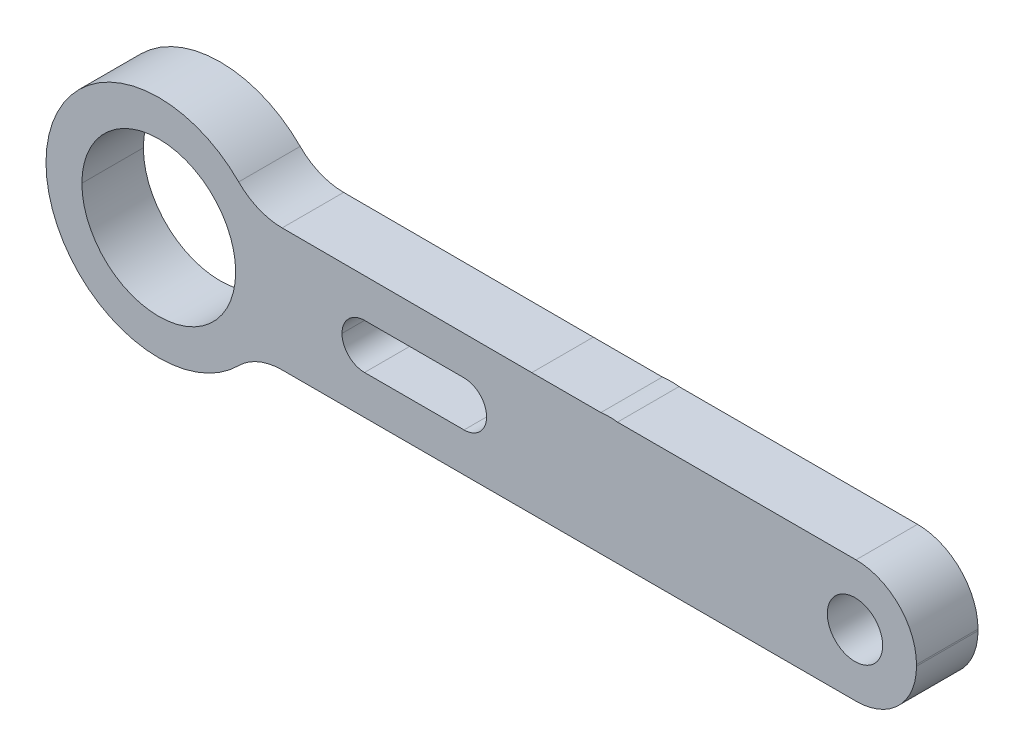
ISO-10303-21;
HEADER;
FILE_DESCRIPTION(('STEP AP214'),'2;1');
FILE_NAME('part.step','',(''),(''),'','','');
FILE_SCHEMA(('AUTOMOTIVE_DESIGN { 1 0 10303 214 1 1 1 1 }'));
ENDSEC;
DATA;
#1=APPLICATION_CONTEXT('core data for automotive mechanical design processes');
#2=APPLICATION_PROTOCOL_DEFINITION('international standard','automotive_design',2000,#1);
#3=PRODUCT_CONTEXT('',#1,'mechanical');
#4=PRODUCT('Part','Part','',(#3));
#5=PRODUCT_RELATED_PRODUCT_CATEGORY('part','',(#4));
#6=PRODUCT_DEFINITION_FORMATION('','',#4);
#7=PRODUCT_DEFINITION_CONTEXT('part definition',#1,'design');
#8=PRODUCT_DEFINITION('design','',#6,#7);
#9=PRODUCT_DEFINITION_SHAPE('','',#8);
#10=(LENGTH_UNIT() NAMED_UNIT(*) SI_UNIT(.MILLI.,.METRE.));
#11=(NAMED_UNIT(*) PLANE_ANGLE_UNIT() SI_UNIT($,.RADIAN.));
#12=(NAMED_UNIT(*) SI_UNIT($,.STERADIAN.) SOLID_ANGLE_UNIT());
#13=UNCERTAINTY_MEASURE_WITH_UNIT(LENGTH_MEASURE(1.E-05),#10,'distance_accuracy_value','');
#14=(GEOMETRIC_REPRESENTATION_CONTEXT(3) GLOBAL_UNCERTAINTY_ASSIGNED_CONTEXT((#13)) GLOBAL_UNIT_ASSIGNED_CONTEXT((#10,
#11,#12)) REPRESENTATION_CONTEXT('',''));
#15=CARTESIAN_POINT('',(0.,0.,0.));
#16=DIRECTION('',(0.,0.,1.));
#17=DIRECTION('',(1.,0.,0.));
#18=AXIS2_PLACEMENT_3D('',#15,#16,#17);
#19=CARTESIAN_POINT('',(-3.98797726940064,21.4662374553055,0.));
#20=DIRECTION('',(0.,0.,1.));
#21=DIRECTION('',(1.,0.,0.));
#22=AXIS2_PLACEMENT_3D('',#19,#20,#21);
#23=PLANE('',#22);
#24=CARTESIAN_POINT('',(8.,21.4662374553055,0.));
#25=DIRECTION('',(0.,0.,1.));
#26=DIRECTION('',(1.,0.,0.));
#27=AXIS2_PLACEMENT_3D('',#24,#25,#26);
#28=CIRCLE('',#27,1.35);
#29=CARTESIAN_POINT('',(9.35,21.4662374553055,0.));
#30=VERTEX_POINT('',#29);
#31=EDGE_CURVE('E210',#30,#30,#28,.T.);
#32=ORIENTED_EDGE('',*,*,#31,.T.);
#33=EDGE_LOOP('',(#32));
#34=FACE_BOUND('',#33,.T.);
#35=CARTESIAN_POINT('',(-15.9219501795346,21.4662374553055,0.));
#36=DIRECTION('',(0.,0.,-1.));
#37=DIRECTION('',(-1.,0.,0.));
#38=AXIS2_PLACEMENT_3D('',#35,#36,#37);
#39=CIRCLE('',#38,1.1);
#40=CARTESIAN_POINT('',(-17.0219501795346,21.4662374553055,0.));
#41=VERTEX_POINT('',#40);
#42=CARTESIAN_POINT('',(-15.9219501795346,20.3662374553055,0.));
#43=VERTEX_POINT('',#42);
#44=EDGE_CURVE('E260',#41,#43,#39,.F.);
#45=ORIENTED_EDGE('',*,*,#44,.T.);
#46=DIRECTION('',(1.,0.,0.));
#47=VECTOR('',#46,1.);
#48=CARTESIAN_POINT('',(-15.9219501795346,20.3662374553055,0.));
#49=LINE('',#48,#47);
#50=CARTESIAN_POINT('',(-11.0683555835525,20.3662374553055,0.));
#51=VERTEX_POINT('',#50);
#52=EDGE_CURVE('E288',#51,#43,#49,.F.);
#53=ORIENTED_EDGE('',*,*,#52,.F.);
#54=CARTESIAN_POINT('',(-11.0683555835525,21.4662374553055,0.));
#55=DIRECTION('',(0.,0.,-1.));
#56=DIRECTION('',(-1.,0.,0.));
#57=AXIS2_PLACEMENT_3D('',#54,#55,#56);
#58=CIRCLE('',#57,1.1);
#59=CARTESIAN_POINT('',(-11.0683555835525,22.5662374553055,0.));
#60=VERTEX_POINT('',#59);
#61=EDGE_CURVE('E251',#51,#60,#58,.F.);
#62=ORIENTED_EDGE('',*,*,#61,.T.);
#63=DIRECTION('',(1.,0.,0.));
#64=VECTOR('',#63,1.);
#65=CARTESIAN_POINT('',(-15.9219501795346,22.5662374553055,0.));
#66=LINE('',#65,#64);
#67=CARTESIAN_POINT('',(-15.9219501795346,22.5662374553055,0.));
#68=VERTEX_POINT('',#67);
#69=EDGE_CURVE('E254',#68,#60,#66,.T.);
#70=ORIENTED_EDGE('',*,*,#69,.F.);
#71=CARTESIAN_POINT('',(-15.9219501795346,21.4662374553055,0.));
#72=DIRECTION('',(0.,0.,-1.));
#73=DIRECTION('',(-1.,0.,0.));
#74=AXIS2_PLACEMENT_3D('',#71,#72,#73);
#75=CIRCLE('',#74,1.1);
#76=EDGE_CURVE('E257',#68,#41,#75,.F.);
#77=ORIENTED_EDGE('',*,*,#76,.T.);
#78=EDGE_LOOP('',(#45,#53,#62,#70,#77));
#79=FACE_BOUND('',#78,.T.);
#80=DIRECTION('',(0.999997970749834,-0.00201457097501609,0.));
#81=VECTOR('',#80,1.);
#82=CARTESIAN_POINT('',(-4.43963692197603,24.4320431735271,0.));
#83=LINE('',#82,#81);
#84=CARTESIAN_POINT('',(-19.940566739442,24.4632709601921,0.));
#85=VERTEX_POINT('',#84);
#86=CARTESIAN_POINT('',(-7.76366421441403,24.4387396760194,0.));
#87=VERTEX_POINT('',#86);
#88=EDGE_CURVE('E280',#85,#87,#83,.T.);
#89=ORIENTED_EDGE('',*,*,#88,.T.);
#90=DIRECTION('',(-1.,0.,0.));
#91=VECTOR('',#90,1.);
#92=CARTESIAN_POINT('',(-7.76366421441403,24.4387396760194,0.));
#93=LINE('',#92,#91);
#94=CARTESIAN_POINT('',(-4.39323095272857,24.4387396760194,0.));
#95=VERTEX_POINT('',#94);
#96=EDGE_CURVE('E205',#95,#87,#93,.T.);
#97=ORIENTED_EDGE('',*,*,#96,.F.);
#98=CARTESIAN_POINT('',(-3.98797726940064,21.4662374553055,0.));
#99=DIRECTION('',(0.,0.,-1.));
#100=DIRECTION('',(-1.,0.,0.));
#101=AXIS2_PLACEMENT_3D('',#98,#99,#100);
#102=CIRCLE('',#101,3.);
#103=CARTESIAN_POINT('',(-3.58272358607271,24.4387396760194,0.));
#104=VERTEX_POINT('',#103);
#105=EDGE_CURVE('E287',#104,#95,#102,.F.);
#106=ORIENTED_EDGE('',*,*,#105,.F.);
#107=CARTESIAN_POINT('',(8.05,24.4387396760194,0.));
#108=VERTEX_POINT('',#107);
#109=EDGE_CURVE('E190',#108,#104,#93,.T.);
#110=ORIENTED_EDGE('',*,*,#109,.F.);
#111=CARTESIAN_POINT('',(8.05,21.4887396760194,0.));
#112=DIRECTION('',(0.,0.,1.));
#113=DIRECTION('',(1.,0.,0.));
#114=AXIS2_PLACEMENT_3D('',#111,#112,#113);
#115=CIRCLE('',#114,2.95);
#116=CARTESIAN_POINT('',(11.,21.4887396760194,0.));
#117=VERTEX_POINT('',#116);
#118=EDGE_CURVE('E199',#117,#108,#115,.T.);
#119=ORIENTED_EDGE('',*,*,#118,.F.);
#120=DIRECTION('',(0.,1.,0.));
#121=VECTOR('',#120,1.);
#122=CARTESIAN_POINT('',(11.,21.4887396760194,0.));
#123=LINE('',#122,#121);
#124=CARTESIAN_POINT('',(11.,21.4162374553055,0.));
#125=VERTEX_POINT('',#124);
#126=EDGE_CURVE('E197',#125,#117,#123,.T.);
#127=ORIENTED_EDGE('',*,*,#126,.F.);
#128=CARTESIAN_POINT('',(8.05,21.4162374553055,0.));
#129=DIRECTION('',(0.,0.,1.));
#130=DIRECTION('',(-1.,0.,0.));
#131=AXIS2_PLACEMENT_3D('',#128,#129,#130);
#132=CIRCLE('',#131,2.95);
#133=CARTESIAN_POINT('',(8.05,18.4662374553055,0.));
#134=VERTEX_POINT('',#133);
#135=EDGE_CURVE('E181',#134,#125,#132,.T.);
#136=ORIENTED_EDGE('',*,*,#135,.F.);
#137=DIRECTION('',(1.,0.,0.));
#138=VECTOR('',#137,1.);
#139=CARTESIAN_POINT('',(-7.76366421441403,18.4662374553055,0.));
#140=LINE('',#139,#138);
#141=CARTESIAN_POINT('',(-3.98797727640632,18.4662374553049,0.));
#142=VERTEX_POINT('',#141);
#143=EDGE_CURVE('E171',#142,#134,#140,.T.);
#144=ORIENTED_EDGE('',*,*,#143,.F.);
#145=DIRECTION('',(-0.999999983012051,-0.000184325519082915,0.));
#146=VECTOR('',#145,1.);
#147=CARTESIAN_POINT('',(-3.98797726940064,18.4662374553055,0.));
#148=LINE('',#147,#146);
#149=CARTESIAN_POINT('',(-19.9409686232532,18.4632969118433,0.));
#150=VERTEX_POINT('',#149);
#151=EDGE_CURVE('E265',#142,#150,#148,.T.);
#152=ORIENTED_EDGE('',*,*,#151,.T.);
#153=CARTESIAN_POINT('',(-19.940415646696,15.4632969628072,0.));
#154=DIRECTION('',(0.,0.,-1.));
#155=DIRECTION('',(-1.,0.,0.));
#156=AXIS2_PLACEMENT_3D('',#153,#154,#155);
#157=CIRCLE('',#156,3.);
#158=CARTESIAN_POINT('',(-22.0643681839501,17.5819818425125,0.));
#159=VERTEX_POINT('',#158);
#160=EDGE_CURVE('E263',#150,#159,#157,.F.);
#161=ORIENTED_EDGE('',*,*,#160,.T.);
#162=CARTESIAN_POINT('',(-25.9582811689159,21.4662374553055,0.));
#163=DIRECTION('',(0.,0.,-1.));
#164=DIRECTION('',(-1.,0.,0.));
#165=AXIS2_PLACEMENT_3D('',#162,#163,#164);
#166=CIRCLE('',#165,5.5);
#167=CARTESIAN_POINT('',(-31.4582811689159,21.4662374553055,0.));
#168=VERTEX_POINT('',#167);
#169=EDGE_CURVE('E268',#168,#159,#166,.F.);
#170=ORIENTED_EDGE('',*,*,#169,.F.);
#171=CARTESIAN_POINT('',(-25.9582811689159,21.4662374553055,0.));
#172=DIRECTION('',(0.,0.,-1.));
#173=DIRECTION('',(-1.,0.,0.));
#174=AXIS2_PLACEMENT_3D('',#171,#172,#173);
#175=CIRCLE('',#174,5.5);
#176=CARTESIAN_POINT('',(-22.0605553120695,25.3466669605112,0.));
#177=VERTEX_POINT('',#176);
#178=EDGE_CURVE('E272',#177,#168,#175,.F.);
#179=ORIENTED_EDGE('',*,*,#178,.F.);
#180=CARTESIAN_POINT('',(-19.9345230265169,27.4632648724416,0.));
#181=DIRECTION('',(0.,0.,-1.));
#182=DIRECTION('',(-1.,0.,0.));
#183=AXIS2_PLACEMENT_3D('',#180,#181,#182);
#184=CIRCLE('',#183,3.);
#185=EDGE_CURVE('E276',#177,#85,#184,.F.);
#186=ORIENTED_EDGE('',*,*,#185,.T.);
#187=EDGE_LOOP('',(#89,#97,#106,#110,#119,#127,#136,#144,#152,#161,#170,#179,#186));
#188=FACE_BOUND('',#187,.T.);
#189=CARTESIAN_POINT('',(-25.9582811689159,21.4662374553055,0.));
#190=DIRECTION('',(0.,0.,-1.));
#191=DIRECTION('',(-1.,0.,0.));
#192=AXIS2_PLACEMENT_3D('',#189,#190,#191);
#193=CIRCLE('',#192,3.75);
#194=CARTESIAN_POINT('',(-22.2082811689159,21.4662374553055,0.));
#195=VERTEX_POINT('',#194);
#196=CARTESIAN_POINT('',(-29.7082811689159,21.4662374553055,0.));
#197=VERTEX_POINT('',#196);
#198=EDGE_CURVE('E284',#195,#197,#193,.F.);
#199=ORIENTED_EDGE('',*,*,#198,.T.);
#200=CARTESIAN_POINT('',(-25.9582811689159,21.4662374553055,0.));
#201=DIRECTION('',(0.,0.,-1.));
#202=DIRECTION('',(-1.,0.,0.));
#203=AXIS2_PLACEMENT_3D('',#200,#201,#202);
#204=CIRCLE('',#203,3.75);
#205=EDGE_CURVE('E34',#197,#195,#204,.F.);
#206=ORIENTED_EDGE('',*,*,#205,.T.);
#207=EDGE_LOOP('',(#199,#206));
#208=FACE_BOUND('',#207,.T.);
#209=ADVANCED_FACE('F31',(#34,#79,#188,#208),#23,.F.);
#210=CARTESIAN_POINT('',(-25.9582811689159,21.4662374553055,3.));
#211=DIRECTION('',(0.,0.,-1.));
#212=DIRECTION('',(-1.,0.,0.));
#213=AXIS2_PLACEMENT_3D('',#210,#211,#212);
#214=CYLINDRICAL_SURFACE('',#213,3.75);
#215=DIRECTION('',(0.,0.,-1.));
#216=VECTOR('',#215,1.);
#217=CARTESIAN_POINT('',(-22.2082811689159,21.4662374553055,3.));
#218=LINE('',#217,#216);
#219=CARTESIAN_POINT('',(-22.2082811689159,21.4662374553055,3.));
#220=VERTEX_POINT('',#219);
#221=EDGE_CURVE('E283',#220,#195,#218,.T.);
#222=ORIENTED_EDGE('',*,*,#221,.T.);
#223=ORIENTED_EDGE('',*,*,#205,.F.);
#224=DIRECTION('',(0.,0.,-1.));
#225=VECTOR('',#224,1.);
#226=CARTESIAN_POINT('',(-29.7082811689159,21.4662374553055,3.));
#227=LINE('',#226,#225);
#228=CARTESIAN_POINT('',(-29.7082811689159,21.4662374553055,3.));
#229=VERTEX_POINT('',#228);
#230=EDGE_CURVE('E281',#197,#229,#227,.F.);
#231=ORIENTED_EDGE('',*,*,#230,.T.);
#232=CARTESIAN_POINT('',(-25.9582811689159,21.4662374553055,3.));
#233=DIRECTION('',(0.,0.,-1.));
#234=DIRECTION('',(-1.,0.,0.));
#235=AXIS2_PLACEMENT_3D('',#232,#233,#234);
#236=CIRCLE('',#235,3.75);
#237=EDGE_CURVE('E313',#220,#229,#236,.T.);
#238=ORIENTED_EDGE('',*,*,#237,.F.);
#239=EDGE_LOOP('',(#222,#223,#231,#238));
#240=FACE_BOUND('',#239,.T.);
#241=ADVANCED_FACE('F331',(#240),#214,.F.);
#242=CARTESIAN_POINT('',(-25.9582811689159,21.4662374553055,3.));
#243=DIRECTION('',(0.,0.,-1.));
#244=DIRECTION('',(-1.,0.,0.));
#245=AXIS2_PLACEMENT_3D('',#242,#243,#244);
#246=CYLINDRICAL_SURFACE('',#245,3.75);
#247=CARTESIAN_POINT('',(-25.9582811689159,21.4662374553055,3.));
#248=DIRECTION('',(0.,0.,-1.));
#249=DIRECTION('',(-1.,0.,0.));
#250=AXIS2_PLACEMENT_3D('',#247,#248,#249);
#251=CIRCLE('',#250,3.75);
#252=EDGE_CURVE('E310',#229,#220,#251,.T.);
#253=ORIENTED_EDGE('',*,*,#252,.F.);
#254=ORIENTED_EDGE('',*,*,#230,.F.);
#255=ORIENTED_EDGE('',*,*,#198,.F.);
#256=ORIENTED_EDGE('',*,*,#221,.F.);
#257=EDGE_LOOP('',(#253,#254,#255,#256));
#258=FACE_BOUND('',#257,.T.);
#259=ADVANCED_FACE('F334',(#258),#246,.F.);
#260=CARTESIAN_POINT('',(-3.98797726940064,21.4662374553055,3.));
#261=DIRECTION('',(0.,0.,-1.));
#262=DIRECTION('',(-1.,0.,0.));
#263=AXIS2_PLACEMENT_3D('',#260,#261,#262);
#264=CYLINDRICAL_SURFACE('',#263,3.);
#265=DIRECTION('',(0.,0.,-1.));
#266=VECTOR('',#265,1.);
#267=CARTESIAN_POINT('',(-3.58272358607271,24.4387396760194,3.));
#268=LINE('',#267,#266);
#269=CARTESIAN_POINT('',(-3.58272358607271,24.4387396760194,3.));
#270=VERTEX_POINT('',#269);
#271=EDGE_CURVE('E47',#104,#270,#268,.F.);
#272=ORIENTED_EDGE('',*,*,#271,.F.);
#273=ORIENTED_EDGE('',*,*,#105,.T.);
#274=DIRECTION('',(0.,0.,-1.));
#275=VECTOR('',#274,1.);
#276=CARTESIAN_POINT('',(-4.39323095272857,24.4387396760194,3.));
#277=LINE('',#276,#275);
#278=CARTESIAN_POINT('',(-4.39323095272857,24.4387396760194,3.));
#279=VERTEX_POINT('',#278);
#280=EDGE_CURVE('E222',#279,#95,#277,.T.);
#281=ORIENTED_EDGE('',*,*,#280,.F.);
#282=CARTESIAN_POINT('',(-3.98797726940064,21.4662374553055,3.));
#283=DIRECTION('',(0.,0.,-1.));
#284=DIRECTION('',(-1.,0.,0.));
#285=AXIS2_PLACEMENT_3D('',#282,#283,#284);
#286=CIRCLE('',#285,3.);
#287=EDGE_CURVE('E244',#270,#279,#286,.F.);
#288=ORIENTED_EDGE('',*,*,#287,.F.);
#289=EDGE_LOOP('',(#272,#273,#281,#288));
#290=FACE_BOUND('',#289,.T.);
#291=ADVANCED_FACE('F392',(#290),#264,.T.);
#292=CARTESIAN_POINT('',(-4.43963692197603,24.4320431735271,3.));
#293=DIRECTION('',(-0.00201457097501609,-0.999997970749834,0.));
#294=DIRECTION('',(0.999997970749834,-0.00201457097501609,0.));
#295=AXIS2_PLACEMENT_3D('',#292,#293,#294);
#296=PLANE('',#295);
#297=DIRECTION('',(-0.999997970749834,0.00201457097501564,0.));
#298=VECTOR('',#297,1.);
#299=CARTESIAN_POINT('',(-4.43963692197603,24.4320431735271,3.));
#300=LINE('',#299,#298);
#301=CARTESIAN_POINT('',(-7.76366421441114,24.4387396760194,3.));
#302=VERTEX_POINT('',#301);
#303=CARTESIAN_POINT('',(-19.940566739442,24.4632709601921,3.));
#304=VERTEX_POINT('',#303);
#305=EDGE_CURVE('E241',#302,#304,#300,.T.);
#306=ORIENTED_EDGE('',*,*,#305,.F.);
#307=DIRECTION('',(0.,0.,1.));
#308=VECTOR('',#307,1.);
#309=CARTESIAN_POINT('',(-7.76366421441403,24.4387396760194,0.));
#310=LINE('',#309,#308);
#311=EDGE_CURVE('E55',#87,#302,#310,.T.);
#312=ORIENTED_EDGE('',*,*,#311,.F.);
#313=ORIENTED_EDGE('',*,*,#88,.F.);
#314=DIRECTION('',(0.,0.,-1.));
#315=VECTOR('',#314,1.);
#316=CARTESIAN_POINT('',(-19.940566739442,24.4632709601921,3.));
#317=LINE('',#316,#315);
#318=EDGE_CURVE('E277',#85,#304,#317,.F.);
#319=ORIENTED_EDGE('',*,*,#318,.T.);
#320=EDGE_LOOP('',(#306,#312,#313,#319));
#321=FACE_BOUND('',#320,.T.);
#322=ADVANCED_FACE('F388',(#321),#296,.F.);
#323=CARTESIAN_POINT('',(-19.9345230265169,27.4632648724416,3.));
#324=DIRECTION('',(0.,0.,-1.));
#325=DIRECTION('',(-1.,0.,0.));
#326=AXIS2_PLACEMENT_3D('',#323,#324,#325);
#327=CYLINDRICAL_SURFACE('',#326,3.);
#328=DIRECTION('',(0.,0.,-1.));
#329=VECTOR('',#328,1.);
#330=CARTESIAN_POINT('',(-22.0605553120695,25.3466669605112,3.));
#331=LINE('',#330,#329);
#332=CARTESIAN_POINT('',(-22.0605553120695,25.3466669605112,3.));
#333=VERTEX_POINT('',#332);
#334=EDGE_CURVE('E273',#333,#177,#331,.T.);
#335=ORIENTED_EDGE('',*,*,#334,.F.);
#336=CARTESIAN_POINT('',(-19.9345230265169,27.4632648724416,3.));
#337=DIRECTION('',(0.,0.,-1.));
#338=DIRECTION('',(-1.,0.,0.));
#339=AXIS2_PLACEMENT_3D('',#336,#337,#338);
#340=CIRCLE('',#339,3.);
#341=EDGE_CURVE('E243',#304,#333,#340,.T.);
#342=ORIENTED_EDGE('',*,*,#341,.F.);
#343=ORIENTED_EDGE('',*,*,#318,.F.);
#344=ORIENTED_EDGE('',*,*,#185,.F.);
#345=EDGE_LOOP('',(#335,#342,#343,#344));
#346=FACE_BOUND('',#345,.T.);
#347=ADVANCED_FACE('F384',(#346),#327,.F.);
#348=CARTESIAN_POINT('',(-25.9582811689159,21.4662374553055,3.));
#349=DIRECTION('',(0.,0.,-1.));
#350=DIRECTION('',(-1.,0.,0.));
#351=AXIS2_PLACEMENT_3D('',#348,#349,#350);
#352=CYLINDRICAL_SURFACE('',#351,5.5);
#353=ORIENTED_EDGE('',*,*,#334,.T.);
#354=ORIENTED_EDGE('',*,*,#178,.T.);
#355=DIRECTION('',(0.,0.,-1.));
#356=VECTOR('',#355,1.);
#357=CARTESIAN_POINT('',(-31.4582811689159,21.4662374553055,3.));
#358=LINE('',#357,#356);
#359=CARTESIAN_POINT('',(-31.4582811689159,21.4662374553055,3.));
#360=VERTEX_POINT('',#359);
#361=EDGE_CURVE('E269',#360,#168,#358,.T.);
#362=ORIENTED_EDGE('',*,*,#361,.F.);
#363=CARTESIAN_POINT('',(-25.9582811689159,21.4662374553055,3.));
#364=DIRECTION('',(0.,0.,-1.));
#365=DIRECTION('',(-1.,0.,0.));
#366=AXIS2_PLACEMENT_3D('',#363,#364,#365);
#367=CIRCLE('',#366,5.5);
#368=EDGE_CURVE('E303',#333,#360,#367,.F.);
#369=ORIENTED_EDGE('',*,*,#368,.F.);
#370=EDGE_LOOP('',(#353,#354,#362,#369));
#371=FACE_BOUND('',#370,.T.);
#372=ADVANCED_FACE('F380',(#371),#352,.T.);
#373=CARTESIAN_POINT('',(-25.9582811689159,21.4662374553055,3.));
#374=DIRECTION('',(0.,0.,-1.));
#375=DIRECTION('',(-1.,0.,0.));
#376=AXIS2_PLACEMENT_3D('',#373,#374,#375);
#377=CYLINDRICAL_SURFACE('',#376,5.5);
#378=ORIENTED_EDGE('',*,*,#169,.T.);
#379=DIRECTION('',(0.,0.,-1.));
#380=VECTOR('',#379,1.);
#381=CARTESIAN_POINT('',(-22.0643681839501,17.5819818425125,3.));
#382=LINE('',#381,#380);
#383=CARTESIAN_POINT('',(-22.0643681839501,17.5819818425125,3.));
#384=VERTEX_POINT('',#383);
#385=EDGE_CURVE('E266',#159,#384,#382,.F.);
#386=ORIENTED_EDGE('',*,*,#385,.T.);
#387=CARTESIAN_POINT('',(-25.9582811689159,21.4662374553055,3.));
#388=DIRECTION('',(0.,0.,-1.));
#389=DIRECTION('',(-1.,0.,0.));
#390=AXIS2_PLACEMENT_3D('',#387,#388,#389);
#391=CIRCLE('',#390,5.5);
#392=EDGE_CURVE('E300',#360,#384,#391,.F.);
#393=ORIENTED_EDGE('',*,*,#392,.F.);
#394=ORIENTED_EDGE('',*,*,#361,.T.);
#395=EDGE_LOOP('',(#378,#386,#393,#394));
#396=FACE_BOUND('',#395,.T.);
#397=ADVANCED_FACE('F376',(#396),#377,.T.);
#398=CARTESIAN_POINT('',(-19.940415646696,15.4632969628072,3.));
#399=DIRECTION('',(0.,0.,-1.));
#400=DIRECTION('',(-1.,0.,0.));
#401=AXIS2_PLACEMENT_3D('',#398,#399,#400);
#402=CYLINDRICAL_SURFACE('',#401,3.);
#403=DIRECTION('',(0.,0.,1.));
#404=VECTOR('',#403,1.);
#405=CARTESIAN_POINT('',(-19.9409686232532,18.4632969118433,3.));
#406=LINE('',#405,#404);
#407=CARTESIAN_POINT('',(-19.9409686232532,18.4632969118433,3.));
#408=VERTEX_POINT('',#407);
#409=EDGE_CURVE('E261',#150,#408,#406,.T.);
#410=ORIENTED_EDGE('',*,*,#409,.T.);
#411=CARTESIAN_POINT('',(-19.940415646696,15.4632969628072,3.));
#412=DIRECTION('',(0.,0.,-1.));
#413=DIRECTION('',(-1.,0.,0.));
#414=AXIS2_PLACEMENT_3D('',#411,#412,#413);
#415=CIRCLE('',#414,3.);
#416=EDGE_CURVE('E240',#384,#408,#415,.T.);
#417=ORIENTED_EDGE('',*,*,#416,.F.);
#418=ORIENTED_EDGE('',*,*,#385,.F.);
#419=ORIENTED_EDGE('',*,*,#160,.F.);
#420=EDGE_LOOP('',(#410,#417,#418,#419));
#421=FACE_BOUND('',#420,.T.);
#422=ADVANCED_FACE('F372',(#421),#402,.F.);
#423=CARTESIAN_POINT('',(-3.98797726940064,18.4662374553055,3.));
#424=DIRECTION('',(-0.000184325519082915,0.999999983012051,0.));
#425=DIRECTION('',(-0.999999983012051,-0.000184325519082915,0.));
#426=AXIS2_PLACEMENT_3D('',#423,#424,#425);
#427=PLANE('',#426);
#428=DIRECTION('',(0.,0.,1.));
#429=VECTOR('',#428,1.);
#430=CARTESIAN_POINT('',(-3.98797726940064,18.4662374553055,3.));
#431=LINE('',#430,#429);
#432=CARTESIAN_POINT('',(-3.98797726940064,18.4662374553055,3.));
#433=VERTEX_POINT('',#432);
#434=EDGE_CURVE('E177',#433,#142,#431,.F.);
#435=ORIENTED_EDGE('',*,*,#434,.F.);
#436=DIRECTION('',(0.999999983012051,0.000184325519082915,0.));
#437=VECTOR('',#436,1.);
#438=CARTESIAN_POINT('',(-19.9409686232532,18.4632969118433,3.));
#439=LINE('',#438,#437);
#440=EDGE_CURVE('E237',#408,#433,#439,.T.);
#441=ORIENTED_EDGE('',*,*,#440,.F.);
#442=ORIENTED_EDGE('',*,*,#409,.F.);
#443=ORIENTED_EDGE('',*,*,#151,.F.);
#444=EDGE_LOOP('',(#435,#441,#442,#443));
#445=FACE_BOUND('',#444,.T.);
#446=ADVANCED_FACE('F368',(#445),#427,.F.);
#447=CARTESIAN_POINT('',(-15.9219501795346,20.3662374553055,3.));
#448=DIRECTION('',(0.,1.,0.));
#449=DIRECTION('',(0.,0.,1.));
#450=AXIS2_PLACEMENT_3D('',#447,#448,#449);
#451=PLANE('',#450);
#452=DIRECTION('',(1.,0.,0.));
#453=VECTOR('',#452,1.);
#454=CARTESIAN_POINT('',(-3.98797726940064,20.3662374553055,3.));
#455=LINE('',#454,#453);
#456=CARTESIAN_POINT('',(-11.0683555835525,20.3662374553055,3.));
#457=VERTEX_POINT('',#456);
#458=CARTESIAN_POINT('',(-15.9219501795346,20.3662374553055,3.));
#459=VERTEX_POINT('',#458);
#460=EDGE_CURVE('E233',#457,#459,#455,.F.);
#461=ORIENTED_EDGE('',*,*,#460,.F.);
#462=DIRECTION('',(0.,0.,-1.));
#463=VECTOR('',#462,1.);
#464=CARTESIAN_POINT('',(-11.0683555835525,20.3662374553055,3.));
#465=LINE('',#464,#463);
#466=EDGE_CURVE('E247',#457,#51,#465,.T.);
#467=ORIENTED_EDGE('',*,*,#466,.T.);
#468=ORIENTED_EDGE('',*,*,#52,.T.);
#469=DIRECTION('',(0.,0.,-1.));
#470=VECTOR('',#469,1.);
#471=CARTESIAN_POINT('',(-15.9219501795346,20.3662374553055,3.));
#472=LINE('',#471,#470);
#473=EDGE_CURVE('E258',#43,#459,#472,.F.);
#474=ORIENTED_EDGE('',*,*,#473,.T.);
#475=EDGE_LOOP('',(#461,#467,#468,#474));
#476=FACE_BOUND('',#475,.T.);
#477=ADVANCED_FACE('F364',(#476),#451,.T.);
#478=CARTESIAN_POINT('',(-15.9219501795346,21.4662374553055,3.));
#479=DIRECTION('',(0.,0.,-1.));
#480=DIRECTION('',(-1.,0.,0.));
#481=AXIS2_PLACEMENT_3D('',#478,#479,#480);
#482=CYLINDRICAL_SURFACE('',#481,1.1);
#483=CARTESIAN_POINT('',(-15.9219501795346,21.4662374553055,3.));
#484=DIRECTION('',(0.,0.,-1.));
#485=DIRECTION('',(-1.,0.,0.));
#486=AXIS2_PLACEMENT_3D('',#483,#484,#485);
#487=CIRCLE('',#486,1.1);
#488=CARTESIAN_POINT('',(-17.0219501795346,21.4662374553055,3.));
#489=VERTEX_POINT('',#488);
#490=EDGE_CURVE('E236',#459,#489,#487,.T.);
#491=ORIENTED_EDGE('',*,*,#490,.F.);
#492=ORIENTED_EDGE('',*,*,#473,.F.);
#493=ORIENTED_EDGE('',*,*,#44,.F.);
#494=DIRECTION('',(0.,0.,-1.));
#495=VECTOR('',#494,1.);
#496=CARTESIAN_POINT('',(-17.0219501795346,21.4662374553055,3.));
#497=LINE('',#496,#495);
#498=EDGE_CURVE('E255',#41,#489,#497,.F.);
#499=ORIENTED_EDGE('',*,*,#498,.T.);
#500=EDGE_LOOP('',(#491,#492,#493,#499));
#501=FACE_BOUND('',#500,.T.);
#502=ADVANCED_FACE('F360',(#501),#482,.F.);
#503=CARTESIAN_POINT('',(-15.9219501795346,21.4662374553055,3.));
#504=DIRECTION('',(0.,0.,-1.));
#505=DIRECTION('',(-1.,0.,0.));
#506=AXIS2_PLACEMENT_3D('',#503,#504,#505);
#507=CYLINDRICAL_SURFACE('',#506,1.1);
#508=ORIENTED_EDGE('',*,*,#498,.F.);
#509=ORIENTED_EDGE('',*,*,#76,.F.);
#510=DIRECTION('',(0.,0.,-1.));
#511=VECTOR('',#510,1.);
#512=CARTESIAN_POINT('',(-15.9219501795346,22.5662374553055,3.));
#513=LINE('',#512,#511);
#514=CARTESIAN_POINT('',(-15.9219501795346,22.5662374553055,3.));
#515=VERTEX_POINT('',#514);
#516=EDGE_CURVE('E248',#515,#68,#513,.T.);
#517=ORIENTED_EDGE('',*,*,#516,.F.);
#518=CARTESIAN_POINT('',(-15.9219501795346,21.4662374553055,3.));
#519=DIRECTION('',(0.,0.,-1.));
#520=DIRECTION('',(-1.,0.,0.));
#521=AXIS2_PLACEMENT_3D('',#518,#519,#520);
#522=CIRCLE('',#521,1.1);
#523=EDGE_CURVE('E232',#489,#515,#522,.T.);
#524=ORIENTED_EDGE('',*,*,#523,.F.);
#525=EDGE_LOOP('',(#508,#509,#517,#524));
#526=FACE_BOUND('',#525,.T.);
#527=ADVANCED_FACE('F356',(#526),#507,.F.);
#528=CARTESIAN_POINT('',(-15.9219501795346,22.5662374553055,3.));
#529=DIRECTION('',(0.,-1.,0.));
#530=DIRECTION('',(0.,0.,-1.));
#531=AXIS2_PLACEMENT_3D('',#528,#529,#530);
#532=PLANE('',#531);
#533=DIRECTION('',(1.,0.,0.));
#534=VECTOR('',#533,1.);
#535=CARTESIAN_POINT('',(-3.98797726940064,22.5662374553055,3.));
#536=LINE('',#535,#534);
#537=CARTESIAN_POINT('',(-11.0683555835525,22.5662374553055,3.));
#538=VERTEX_POINT('',#537);
#539=EDGE_CURVE('E39',#515,#538,#536,.T.);
#540=ORIENTED_EDGE('',*,*,#539,.F.);
#541=ORIENTED_EDGE('',*,*,#516,.T.);
#542=ORIENTED_EDGE('',*,*,#69,.T.);
#543=DIRECTION('',(0.,0.,-1.));
#544=VECTOR('',#543,1.);
#545=CARTESIAN_POINT('',(-11.0683555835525,22.5662374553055,3.));
#546=LINE('',#545,#544);
#547=EDGE_CURVE('E245',#60,#538,#546,.F.);
#548=ORIENTED_EDGE('',*,*,#547,.T.);
#549=EDGE_LOOP('',(#540,#541,#542,#548));
#550=FACE_BOUND('',#549,.T.);
#551=ADVANCED_FACE('F347',(#550),#532,.T.);
#552=CARTESIAN_POINT('',(-11.0683555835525,21.4662374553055,3.));
#553=DIRECTION('',(0.,0.,-1.));
#554=DIRECTION('',(-1.,0.,0.));
#555=AXIS2_PLACEMENT_3D('',#552,#553,#554);
#556=CYLINDRICAL_SURFACE('',#555,1.1);
#557=ORIENTED_EDGE('',*,*,#466,.F.);
#558=CARTESIAN_POINT('',(-11.0683555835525,21.4662374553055,3.));
#559=DIRECTION('',(0.,0.,-1.));
#560=DIRECTION('',(-1.,0.,0.));
#561=AXIS2_PLACEMENT_3D('',#558,#559,#560);
#562=CIRCLE('',#561,1.1);
#563=EDGE_CURVE('E11',#538,#457,#562,.T.);
#564=ORIENTED_EDGE('',*,*,#563,.F.);
#565=ORIENTED_EDGE('',*,*,#547,.F.);
#566=ORIENTED_EDGE('',*,*,#61,.F.);
#567=EDGE_LOOP('',(#557,#564,#565,#566));
#568=FACE_BOUND('',#567,.T.);
#569=ADVANCED_FACE('F338',(#568),#556,.F.);
#570=CARTESIAN_POINT('',(-3.98797726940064,21.4662374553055,3.));
#571=DIRECTION('',(0.,0.,1.));
#572=DIRECTION('',(1.,0.,0.));
#573=AXIS2_PLACEMENT_3D('',#570,#571,#572);
#574=PLANE('',#573);
#575=CARTESIAN_POINT('',(8.,21.4662374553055,3.));
#576=DIRECTION('',(0.,0.,1.));
#577=DIRECTION('',(1.,0.,0.));
#578=AXIS2_PLACEMENT_3D('',#575,#576,#577);
#579=CIRCLE('',#578,1.35);
#580=CARTESIAN_POINT('',(9.35,21.4662374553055,3.));
#581=VERTEX_POINT('',#580);
#582=EDGE_CURVE('E420',#581,#581,#579,.T.);
#583=ORIENTED_EDGE('',*,*,#582,.F.);
#584=EDGE_LOOP('',(#583));
#585=FACE_BOUND('',#584,.T.);
#586=ORIENTED_EDGE('',*,*,#287,.T.);
#587=DIRECTION('',(-1.,0.,0.));
#588=VECTOR('',#587,1.);
#589=CARTESIAN_POINT('',(-7.76366421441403,24.4387396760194,3.));
#590=LINE('',#589,#588);
#591=EDGE_CURVE('E218',#279,#302,#590,.T.);
#592=ORIENTED_EDGE('',*,*,#591,.T.);
#593=ORIENTED_EDGE('',*,*,#305,.T.);
#594=ORIENTED_EDGE('',*,*,#341,.T.);
#595=ORIENTED_EDGE('',*,*,#368,.T.);
#596=ORIENTED_EDGE('',*,*,#392,.T.);
#597=ORIENTED_EDGE('',*,*,#416,.T.);
#598=ORIENTED_EDGE('',*,*,#440,.T.);
#599=DIRECTION('',(1.,0.,0.));
#600=VECTOR('',#599,1.);
#601=CARTESIAN_POINT('',(-7.76366421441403,18.4662374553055,3.));
#602=LINE('',#601,#600);
#603=CARTESIAN_POINT('',(8.05,18.4662374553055,3.));
#604=VERTEX_POINT('',#603);
#605=EDGE_CURVE('E208',#433,#604,#602,.T.);
#606=ORIENTED_EDGE('',*,*,#605,.T.);
#607=CARTESIAN_POINT('',(8.05,21.4162374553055,3.));
#608=DIRECTION('',(0.,0.,1.));
#609=DIRECTION('',(-1.,0.,0.));
#610=AXIS2_PLACEMENT_3D('',#607,#608,#609);
#611=CIRCLE('',#610,2.95);
#612=CARTESIAN_POINT('',(11.,21.4162374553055,3.));
#613=VERTEX_POINT('',#612);
#614=EDGE_CURVE('E188',#604,#613,#611,.T.);
#615=ORIENTED_EDGE('',*,*,#614,.T.);
#616=DIRECTION('',(0.,1.,0.));
#617=VECTOR('',#616,1.);
#618=CARTESIAN_POINT('',(11.,21.4887396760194,3.));
#619=LINE('',#618,#617);
#620=CARTESIAN_POINT('',(11.,21.4887396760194,3.));
#621=VERTEX_POINT('',#620);
#622=EDGE_CURVE('E212',#613,#621,#619,.T.);
#623=ORIENTED_EDGE('',*,*,#622,.T.);
#624=CARTESIAN_POINT('',(8.05,21.4887396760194,3.));
#625=DIRECTION('',(0.,0.,1.));
#626=DIRECTION('',(1.,0.,0.));
#627=AXIS2_PLACEMENT_3D('',#624,#625,#626);
#628=CIRCLE('',#627,2.95);
#629=CARTESIAN_POINT('',(8.05,24.4387396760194,3.));
#630=VERTEX_POINT('',#629);
#631=EDGE_CURVE('E215',#621,#630,#628,.T.);
#632=ORIENTED_EDGE('',*,*,#631,.T.);
#633=EDGE_CURVE('E182',#630,#270,#590,.T.);
#634=ORIENTED_EDGE('',*,*,#633,.T.);
#635=EDGE_LOOP('',(#586,#592,#593,#594,#595,#596,#597,#598,#606,#615,#623,#632,#634));
#636=FACE_BOUND('',#635,.T.);
#637=ORIENTED_EDGE('',*,*,#539,.T.);
#638=ORIENTED_EDGE('',*,*,#563,.T.);
#639=ORIENTED_EDGE('',*,*,#460,.T.);
#640=ORIENTED_EDGE('',*,*,#490,.T.);
#641=ORIENTED_EDGE('',*,*,#523,.T.);
#642=EDGE_LOOP('',(#637,#638,#639,#640,#641));
#643=FACE_BOUND('',#642,.T.);
#644=ORIENTED_EDGE('',*,*,#237,.T.);
#645=ORIENTED_EDGE('',*,*,#252,.T.);
#646=EDGE_LOOP('',(#644,#645));
#647=FACE_BOUND('',#646,.T.);
#648=ADVANCED_FACE('F336',(#585,#636,#643,#647),#574,.T.);
#649=CARTESIAN_POINT('',(8.05,21.4162374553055,0.));
#650=DIRECTION('',(0.,0.,1.));
#651=DIRECTION('',(1.,0.,0.));
#652=AXIS2_PLACEMENT_3D('',#649,#650,#651);
#653=CYLINDRICAL_SURFACE('',#652,2.95);
#654=ORIENTED_EDGE('',*,*,#614,.F.);
#655=DIRECTION('',(0.,0.,1.));
#656=VECTOR('',#655,1.);
#657=CARTESIAN_POINT('',(8.05,18.4662374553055,0.));
#658=LINE('',#657,#656);
#659=EDGE_CURVE('E175',#134,#604,#658,.T.);
#660=ORIENTED_EDGE('',*,*,#659,.F.);
#661=ORIENTED_EDGE('',*,*,#135,.T.);
#662=DIRECTION('',(0.,0.,1.));
#663=VECTOR('',#662,1.);
#664=CARTESIAN_POINT('',(11.,21.4162374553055,0.));
#665=LINE('',#664,#663);
#666=EDGE_CURVE('E189',#125,#613,#665,.T.);
#667=ORIENTED_EDGE('',*,*,#666,.T.);
#668=EDGE_LOOP('',(#654,#660,#661,#667));
#669=FACE_BOUND('',#668,.T.);
#670=ADVANCED_FACE('F186',(#669),#653,.T.);
#671=CARTESIAN_POINT('',(11.,21.4887396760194,0.));
#672=DIRECTION('',(1.,0.,0.));
#673=DIRECTION('',(0.,1.,0.));
#674=AXIS2_PLACEMENT_3D('',#671,#672,#673);
#675=PLANE('',#674);
#676=ORIENTED_EDGE('',*,*,#622,.F.);
#677=ORIENTED_EDGE('',*,*,#666,.F.);
#678=ORIENTED_EDGE('',*,*,#126,.T.);
#679=DIRECTION('',(0.,0.,1.));
#680=VECTOR('',#679,1.);
#681=CARTESIAN_POINT('',(11.,21.4887396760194,0.));
#682=LINE('',#681,#680);
#683=EDGE_CURVE('E225',#117,#621,#682,.T.);
#684=ORIENTED_EDGE('',*,*,#683,.T.);
#685=EDGE_LOOP('',(#676,#677,#678,#684));
#686=FACE_BOUND('',#685,.T.);
#687=ADVANCED_FACE('F345',(#686),#675,.T.);
#688=CARTESIAN_POINT('',(8.05,21.4887396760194,0.));
#689=DIRECTION('',(0.,0.,1.));
#690=DIRECTION('',(1.,0.,0.));
#691=AXIS2_PLACEMENT_3D('',#688,#689,#690);
#692=CYLINDRICAL_SURFACE('',#691,2.95);
#693=ORIENTED_EDGE('',*,*,#631,.F.);
#694=ORIENTED_EDGE('',*,*,#683,.F.);
#695=ORIENTED_EDGE('',*,*,#118,.T.);
#696=DIRECTION('',(0.,0.,1.));
#697=VECTOR('',#696,1.);
#698=CARTESIAN_POINT('',(8.05,24.4387396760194,0.));
#699=LINE('',#698,#697);
#700=EDGE_CURVE('E223',#108,#630,#699,.T.);
#701=ORIENTED_EDGE('',*,*,#700,.T.);
#702=EDGE_LOOP('',(#693,#694,#695,#701));
#703=FACE_BOUND('',#702,.T.);
#704=ADVANCED_FACE('F434',(#703),#692,.T.);
#705=CARTESIAN_POINT('',(-7.76366421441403,18.4662374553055,0.));
#706=DIRECTION('',(0.,-1.,0.));
#707=DIRECTION('',(0.,0.,-1.));
#708=AXIS2_PLACEMENT_3D('',#705,#706,#707);
#709=PLANE('',#708);
#710=ORIENTED_EDGE('',*,*,#434,.T.);
#711=ORIENTED_EDGE('',*,*,#143,.T.);
#712=ORIENTED_EDGE('',*,*,#659,.T.);
#713=ORIENTED_EDGE('',*,*,#605,.F.);
#714=EDGE_LOOP('',(#710,#711,#712,#713));
#715=FACE_BOUND('',#714,.T.);
#716=ADVANCED_FACE('F173',(#715),#709,.T.);
#717=CARTESIAN_POINT('',(-7.76366421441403,24.4387396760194,0.));
#718=DIRECTION('',(0.,1.,0.));
#719=DIRECTION('',(0.,0.,1.));
#720=AXIS2_PLACEMENT_3D('',#717,#718,#719);
#721=PLANE('',#720);
#722=ORIENTED_EDGE('',*,*,#109,.T.);
#723=ORIENTED_EDGE('',*,*,#271,.T.);
#724=ORIENTED_EDGE('',*,*,#633,.F.);
#725=ORIENTED_EDGE('',*,*,#700,.F.);
#726=EDGE_LOOP('',(#722,#723,#724,#725));
#727=FACE_BOUND('',#726,.T.);
#728=ADVANCED_FACE('F431',(#727),#721,.T.);
#729=ORIENTED_EDGE('',*,*,#591,.F.);
#730=ORIENTED_EDGE('',*,*,#280,.T.);
#731=ORIENTED_EDGE('',*,*,#96,.T.);
#732=ORIENTED_EDGE('',*,*,#311,.T.);
#733=EDGE_LOOP('',(#729,#730,#731,#732));
#734=FACE_BOUND('',#733,.T.);
#735=ADVANCED_FACE('F426',(#734),#721,.T.);
#736=CARTESIAN_POINT('',(8.,21.4662374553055,0.));
#737=DIRECTION('',(0.,0.,1.));
#738=DIRECTION('',(1.,0.,0.));
#739=AXIS2_PLACEMENT_3D('',#736,#737,#738);
#740=CYLINDRICAL_SURFACE('',#739,1.35);
#741=ORIENTED_EDGE('',*,*,#31,.F.);
#742=EDGE_LOOP('',(#741));
#743=FACE_BOUND('',#742,.T.);
#744=ORIENTED_EDGE('',*,*,#582,.T.);
#745=EDGE_LOOP('',(#744));
#746=FACE_BOUND('',#745,.T.);
#747=ADVANCED_FACE('F424',(#743,#746),#740,.F.);
#748=CLOSED_SHELL('',(#209,#241,#259,#291,#322,#347,#372,#397,#422,#446,#477,#502,#527,#551,
#569,#648,#670,#687,#704,#716,#728,#735,#747));
#749=MANIFOLD_SOLID_BREP('B2',#748);
#750=ADVANCED_BREP_SHAPE_REPRESENTATION('',(#18,#749),#14);
#751=SHAPE_DEFINITION_REPRESENTATION(#9,#750);
ENDSEC;
END-ISO-10303-21;
